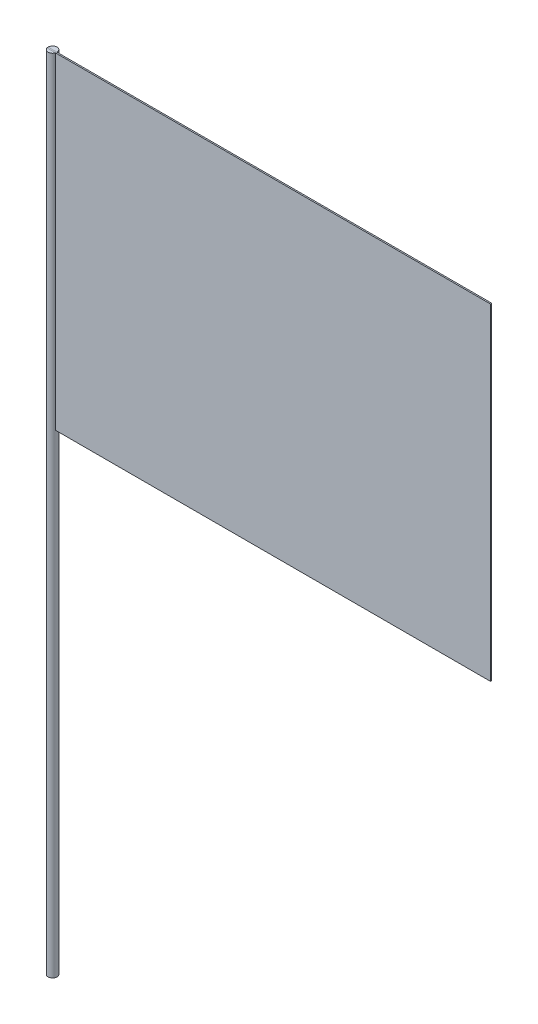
ISO-10303-21;
HEADER;
FILE_DESCRIPTION(('STEP AP214'),'2;1');
FILE_NAME('part.step','',(''),(''),'','','');
FILE_SCHEMA(('AUTOMOTIVE_DESIGN { 1 0 10303 214 1 1 1 1 }'));
ENDSEC;
DATA;
#1=APPLICATION_CONTEXT('core data for automotive mechanical design processes');
#2=APPLICATION_PROTOCOL_DEFINITION('international standard','automotive_design',2000,#1);
#3=PRODUCT_CONTEXT('',#1,'mechanical');
#4=PRODUCT('Part','Part','',(#3));
#5=PRODUCT_RELATED_PRODUCT_CATEGORY('part','',(#4));
#6=PRODUCT_DEFINITION_FORMATION('','',#4);
#7=PRODUCT_DEFINITION_CONTEXT('part definition',#1,'design');
#8=PRODUCT_DEFINITION('design','',#6,#7);
#9=PRODUCT_DEFINITION_SHAPE('','',#8);
#10=(LENGTH_UNIT() NAMED_UNIT(*) SI_UNIT(.MILLI.,.METRE.));
#11=(NAMED_UNIT(*) PLANE_ANGLE_UNIT() SI_UNIT($,.RADIAN.));
#12=(NAMED_UNIT(*) SI_UNIT($,.STERADIAN.) SOLID_ANGLE_UNIT());
#13=UNCERTAINTY_MEASURE_WITH_UNIT(LENGTH_MEASURE(1.E-05),#10,'distance_accuracy_value','');
#14=(GEOMETRIC_REPRESENTATION_CONTEXT(3) GLOBAL_UNCERTAINTY_ASSIGNED_CONTEXT((#13)) GLOBAL_UNIT_ASSIGNED_CONTEXT((#10,
#11,#12)) REPRESENTATION_CONTEXT('',''));
#15=CARTESIAN_POINT('',(0.,0.,0.));
#16=DIRECTION('',(0.,0.,1.));
#17=DIRECTION('',(1.,0.,0.));
#18=AXIS2_PLACEMENT_3D('',#15,#16,#17);
#19=CARTESIAN_POINT('',(-5.08,914.4,1.524));
#20=DIRECTION('',(1.,0.,0.));
#21=DIRECTION('',(0.,0.,-1.));
#22=AXIS2_PLACEMENT_3D('',#19,#20,#21);
#23=PLANE('',#22);
#24=DIRECTION('',(0.,-1.,0.));
#25=VECTOR('',#24,1.);
#26=CARTESIAN_POINT('',(-5.08,914.4,0.));
#27=LINE('',#26,#25);
#28=CARTESIAN_POINT('',(-5.08,914.4,0.));
#29=VERTEX_POINT('',#28);
#30=CARTESIAN_POINT('',(-5.08,541.246978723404,0.));
#31=VERTEX_POINT('',#30);
#32=EDGE_CURVE('E86',#29,#31,#27,.T.);
#33=ORIENTED_EDGE('',*,*,#32,.T.);
#34=DIRECTION('',(0.,0.,-1.));
#35=VECTOR('',#34,1.);
#36=CARTESIAN_POINT('',(-5.08,541.246978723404,1.524));
#37=LINE('',#36,#35);
#38=CARTESIAN_POINT('',(-5.08,541.246978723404,1.524));
#39=VERTEX_POINT('',#38);
#40=EDGE_CURVE('E12',#39,#31,#37,.T.);
#41=ORIENTED_EDGE('',*,*,#40,.F.);
#42=DIRECTION('',(0.,-1.,0.));
#43=VECTOR('',#42,1.);
#44=CARTESIAN_POINT('',(-5.08,914.4,1.524));
#45=LINE('',#44,#43);
#46=CARTESIAN_POINT('',(-5.08,914.4,1.524));
#47=VERTEX_POINT('',#46);
#48=EDGE_CURVE('E104',#47,#39,#45,.T.);
#49=ORIENTED_EDGE('',*,*,#48,.F.);
#50=DIRECTION('',(0.,0.,-1.));
#51=VECTOR('',#50,1.);
#52=CARTESIAN_POINT('',(-5.08,914.4,1.524));
#53=LINE('',#52,#51);
#54=EDGE_CURVE('E98',#47,#29,#53,.T.);
#55=ORIENTED_EDGE('',*,*,#54,.T.);
#56=EDGE_LOOP('',(#33,#41,#49,#55));
#57=FACE_BOUND('',#56,.T.);
#58=ADVANCED_FACE('F42',(#57),#23,.F.);
#59=CARTESIAN_POINT('',(-5.08,541.246978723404,1.524));
#60=DIRECTION('',(0.,1.,0.));
#61=DIRECTION('',(0.,0.,1.));
#62=AXIS2_PLACEMENT_3D('',#59,#60,#61);
#63=PLANE('',#62);
#64=DIRECTION('',(1.,0.,0.));
#65=VECTOR('',#64,1.);
#66=CARTESIAN_POINT('',(-5.08,541.246978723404,0.));
#67=LINE('',#66,#65);
#68=CARTESIAN_POINT('',(501.480306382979,541.246978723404,0.));
#69=VERTEX_POINT('',#68);
#70=EDGE_CURVE('E82',#31,#69,#67,.T.);
#71=ORIENTED_EDGE('',*,*,#70,.T.);
#72=DIRECTION('',(0.,0.,-1.));
#73=VECTOR('',#72,1.);
#74=CARTESIAN_POINT('',(501.480306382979,541.246978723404,1.524));
#75=LINE('',#74,#73);
#76=CARTESIAN_POINT('',(501.480306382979,541.246978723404,1.524));
#77=VERTEX_POINT('',#76);
#78=EDGE_CURVE('E49',#77,#69,#75,.T.);
#79=ORIENTED_EDGE('',*,*,#78,.F.);
#80=DIRECTION('',(1.,0.,0.));
#81=VECTOR('',#80,1.);
#82=CARTESIAN_POINT('',(-5.08,541.246978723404,1.524));
#83=LINE('',#82,#81);
#84=EDGE_CURVE('E94',#39,#77,#83,.T.);
#85=ORIENTED_EDGE('',*,*,#84,.F.);
#86=ORIENTED_EDGE('',*,*,#40,.T.);
#87=EDGE_LOOP('',(#71,#79,#85,#86));
#88=FACE_BOUND('',#87,.T.);
#89=ADVANCED_FACE('F93',(#88),#63,.F.);
#90=CARTESIAN_POINT('',(501.480306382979,914.4,1.524));
#91=DIRECTION('',(-1.,0.,0.));
#92=DIRECTION('',(0.,0.,1.));
#93=AXIS2_PLACEMENT_3D('',#90,#91,#92);
#94=PLANE('',#93);
#95=DIRECTION('',(0.,1.,0.));
#96=VECTOR('',#95,1.);
#97=CARTESIAN_POINT('',(501.480306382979,914.4,0.));
#98=LINE('',#97,#96);
#99=CARTESIAN_POINT('',(501.480306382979,914.4,0.));
#100=VERTEX_POINT('',#99);
#101=EDGE_CURVE('E87',#69,#100,#98,.T.);
#102=ORIENTED_EDGE('',*,*,#101,.T.);
#103=DIRECTION('',(0.,0.,-1.));
#104=VECTOR('',#103,1.);
#105=CARTESIAN_POINT('',(501.480306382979,914.4,1.524));
#106=LINE('',#105,#104);
#107=CARTESIAN_POINT('',(501.480306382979,914.4,1.524));
#108=VERTEX_POINT('',#107);
#109=EDGE_CURVE('E110',#108,#100,#106,.T.);
#110=ORIENTED_EDGE('',*,*,#109,.F.);
#111=DIRECTION('',(0.,1.,0.));
#112=VECTOR('',#111,1.);
#113=CARTESIAN_POINT('',(501.480306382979,914.4,1.524));
#114=LINE('',#113,#112);
#115=EDGE_CURVE('E61',#77,#108,#114,.T.);
#116=ORIENTED_EDGE('',*,*,#115,.F.);
#117=ORIENTED_EDGE('',*,*,#78,.T.);
#118=EDGE_LOOP('',(#102,#110,#116,#117));
#119=FACE_BOUND('',#118,.T.);
#120=ADVANCED_FACE('F113',(#119),#94,.F.);
#121=CARTESIAN_POINT('',(-5.08,914.4,1.524));
#122=DIRECTION('',(0.,-1.,0.));
#123=DIRECTION('',(0.,0.,-1.));
#124=AXIS2_PLACEMENT_3D('',#121,#122,#123);
#125=PLANE('',#124);
#126=DIRECTION('',(-1.,0.,0.));
#127=VECTOR('',#126,1.);
#128=CARTESIAN_POINT('',(-5.08,914.4,0.));
#129=LINE('',#128,#127);
#130=EDGE_CURVE('E102',#100,#29,#129,.T.);
#131=ORIENTED_EDGE('',*,*,#130,.T.);
#132=ORIENTED_EDGE('',*,*,#54,.F.);
#133=DIRECTION('',(-1.,0.,0.));
#134=VECTOR('',#133,1.);
#135=CARTESIAN_POINT('',(-5.08,914.4,1.524));
#136=LINE('',#135,#134);
#137=EDGE_CURVE('E56',#108,#47,#136,.T.);
#138=ORIENTED_EDGE('',*,*,#137,.F.);
#139=ORIENTED_EDGE('',*,*,#109,.T.);
#140=EDGE_LOOP('',(#131,#132,#138,#139));
#141=FACE_BOUND('',#140,.T.);
#142=ADVANCED_FACE('F115',(#141),#125,.F.);
#143=CARTESIAN_POINT('',(-5.08,541.246978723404,1.524));
#144=DIRECTION('',(0.,0.,1.));
#145=DIRECTION('',(1.,0.,0.));
#146=AXIS2_PLACEMENT_3D('',#143,#144,#145);
#147=PLANE('',#146);
#148=ORIENTED_EDGE('',*,*,#48,.T.);
#149=ORIENTED_EDGE('',*,*,#84,.T.);
#150=ORIENTED_EDGE('',*,*,#115,.T.);
#151=ORIENTED_EDGE('',*,*,#137,.T.);
#152=EDGE_LOOP('',(#148,#149,#150,#151));
#153=FACE_BOUND('',#152,.T.);
#154=ADVANCED_FACE('F116',(#153),#147,.T.);
#155=CARTESIAN_POINT('',(-5.08,541.246978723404,0.));
#156=DIRECTION('',(0.,0.,1.));
#157=DIRECTION('',(1.,0.,0.));
#158=AXIS2_PLACEMENT_3D('',#155,#156,#157);
#159=PLANE('',#158);
#160=ORIENTED_EDGE('',*,*,#32,.F.);
#161=ORIENTED_EDGE('',*,*,#130,.F.);
#162=ORIENTED_EDGE('',*,*,#101,.F.);
#163=ORIENTED_EDGE('',*,*,#70,.F.);
#164=EDGE_LOOP('',(#160,#161,#162,#163));
#165=FACE_BOUND('',#164,.T.);
#166=ADVANCED_FACE('F83',(#165),#159,.F.);
#167=CLOSED_SHELL('',(#58,#89,#120,#142,#154,#166));
#168=MANIFOLD_SOLID_BREP('B2',#167);
#169=CARTESIAN_POINT('',(0.,914.4,0.));
#170=DIRECTION('',(0.,-1.,0.));
#171=DIRECTION('',(0.,0.,-1.));
#172=AXIS2_PLACEMENT_3D('',#169,#170,#171);
#173=CYLINDRICAL_SURFACE('',#172,5.08);
#174=CARTESIAN_POINT('',(0.,914.4,0.));
#175=DIRECTION('',(0.,1.,0.));
#176=DIRECTION('',(0.,0.,1.));
#177=AXIS2_PLACEMENT_3D('',#174,#175,#176);
#178=CIRCLE('',#177,5.08);
#179=CARTESIAN_POINT('',(0.,914.4,5.08));
#180=VERTEX_POINT('',#179);
#181=EDGE_CURVE('E41',#180,#180,#178,.T.);
#182=ORIENTED_EDGE('',*,*,#181,.F.);
#183=EDGE_LOOP('',(#182));
#184=FACE_BOUND('',#183,.T.);
#185=CARTESIAN_POINT('',(0.,0.,0.));
#186=DIRECTION('',(0.,1.,0.));
#187=DIRECTION('',(0.,0.,1.));
#188=AXIS2_PLACEMENT_3D('',#185,#186,#187);
#189=CIRCLE('',#188,5.08);
#190=CARTESIAN_POINT('',(0.,0.,5.08));
#191=VERTEX_POINT('',#190);
#192=EDGE_CURVE('E171',#191,#191,#189,.T.);
#193=ORIENTED_EDGE('',*,*,#192,.T.);
#194=EDGE_LOOP('',(#193));
#195=FACE_BOUND('',#194,.T.);
#196=ADVANCED_FACE('F165',(#184,#195),#173,.T.);
#197=CARTESIAN_POINT('',(0.,914.4,0.));
#198=DIRECTION('',(0.,1.,0.));
#199=DIRECTION('',(0.,0.,1.));
#200=AXIS2_PLACEMENT_3D('',#197,#198,#199);
#201=PLANE('',#200);
#202=ORIENTED_EDGE('',*,*,#181,.T.);
#203=EDGE_LOOP('',(#202));
#204=FACE_BOUND('',#203,.T.);
#205=ADVANCED_FACE('F180',(#204),#201,.T.);
#206=CARTESIAN_POINT('',(0.,0.,0.));
#207=DIRECTION('',(0.,1.,0.));
#208=DIRECTION('',(0.,0.,1.));
#209=AXIS2_PLACEMENT_3D('',#206,#207,#208);
#210=PLANE('',#209);
#211=ORIENTED_EDGE('',*,*,#192,.F.);
#212=EDGE_LOOP('',(#211));
#213=FACE_BOUND('',#212,.T.);
#214=ADVANCED_FACE('F178',(#213),#210,.F.);
#215=CLOSED_SHELL('',(#196,#205,#214));
#216=MANIFOLD_SOLID_BREP('B6',#215);
#217=ADVANCED_BREP_SHAPE_REPRESENTATION('',(#18,#168,#216),#14);
#218=SHAPE_DEFINITION_REPRESENTATION(#9,#217);
ENDSEC;
END-ISO-10303-21;
